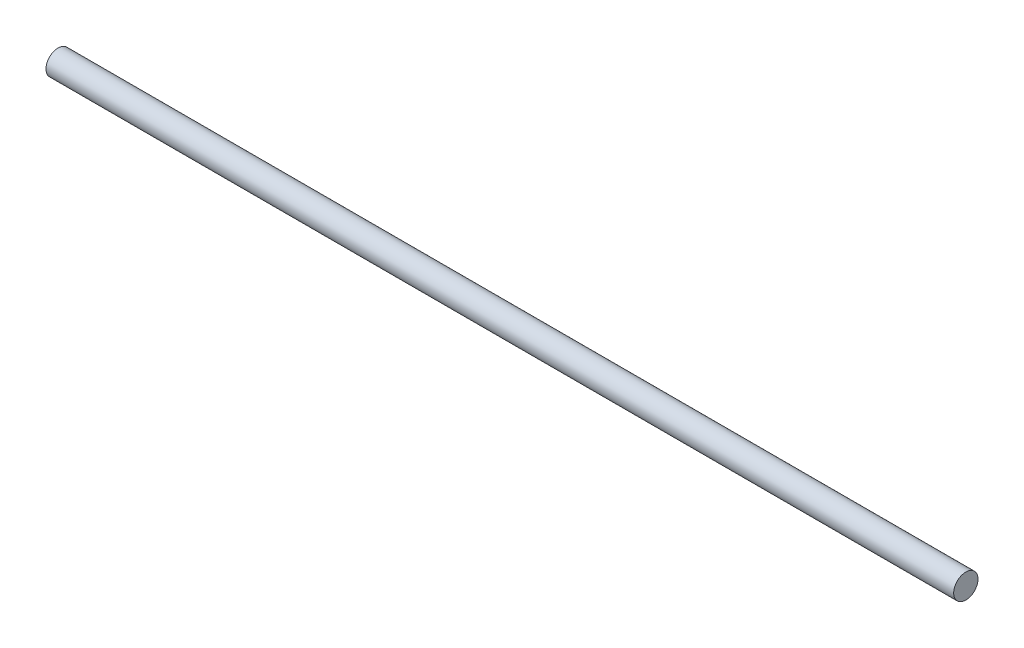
from build123d import *

# Parameters (mm, degrees)
SKETCH1_R           = 2
BOSS_EXTRUDE1_DEPTH = 149.225


with BuildPart() as part:
    # Sketch1 → Boss-Extrude1 (new body)
    with BuildSketch(Plane(origin=(0, 0, 0), x_dir=(0, 0, -1), z_dir=(1, 0, 0))):
        Circle(SKETCH1_R)
    extrude(amount=BOSS_EXTRUDE1_DEPTH)


solid = part.part
